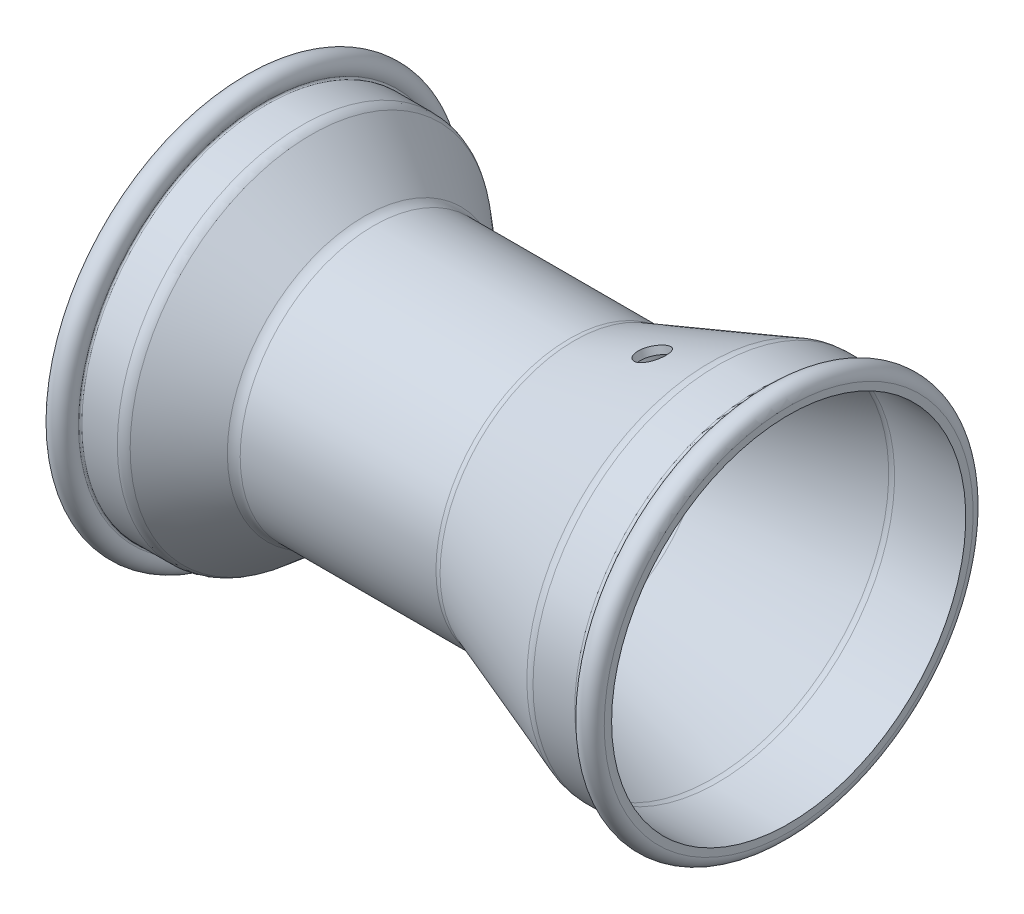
from build123d import *

# Parameters (mm, degrees)
ENL_V_MAT_EXTRU_1_REACH      = 197.343
ESQUISSE2_R                  = 5
ESQUISSE3_R                  = 4.5
ENL_V_MAT_EXTRU_2_DEPTH      = 155.667385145
R_P_TITION_CIRCULAIRE1_COUNT = 3


with BuildPart() as part:
    # Esquisse1 → Base-R_volution (revolve)
    with BuildSketch(Plane.XY, mode=Mode.PRIVATE) as base_r_volution_sk:
        with BuildLine():
            Line((-141.555203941, 65), (-141.555203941, 61))
            Line((-141.555203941, 61), (-141.555203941, 60))
            Line((-141.555203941, 60), (-137.74427744, 60))
            Line((-137.74427744, 60), (-121.555203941, 60))
            ThreePointArc((-121.555203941, 60), (-120.704160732, 59.850686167), (-119.954775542, 59.420580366))
            Line((-119.954775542, 59.420580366), (-101.993796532, 44.453614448))
            ThreePointArc((-101.993796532, 44.453614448), (-99.745640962, 43.163297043), (-97.192511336, 42.715355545))
            Line((-97.192511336, 42.715355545), (-78.555203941, 42.715355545))
            ThreePointArc((-78.555203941, 42.715355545), (-77.140990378, 42.129569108), (-76.555203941, 40.715355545))
            Line((-76.555203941, 40.715355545), (-76.555203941, 20))
            Line((-76.555203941, 20), (-69.555203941, 20))
            Line((-69.555203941, 20), (-69.555203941, 40.715355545))
            ThreePointArc((-69.555203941, 40.715355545), (-68.969417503, 42.129569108), (-67.555203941, 42.715355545))
            Line((-67.555203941, 42.715355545), (-30.864418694, 42.715355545))
            ThreePointArc((-30.864418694, 42.715355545), (-29.574706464, 42.827078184), (-28.323418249, 43.158917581))
            Line((-28.323418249, 43.158917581), (17.623605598, 59.704291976))
            ThreePointArc((17.623605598, 59.704291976), (18.457797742, 59.925518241), (19.317605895, 60))
            Line((19.317605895, 60), (35.506679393, 60))
            Line((35.506679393, 60), (43.444796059, 60))
            Line((43.444796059, 60), (43.444796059, 61))
            Line((43.444796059, 61), (43.444796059, 62.5))
            ThreePointArc((43.444796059, 62.5), (40.2292606, 66.422322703), (35.752488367, 64.038461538))
            ThreePointArc((35.752488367, 64.038461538), (34.83154655, 62.919874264), (33.444796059, 62.5))
            Line((33.444796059, 62.5), (19.317605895, 62.5))
            ThreePointArc((19.317605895, 62.5), (18.027893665, 62.388277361), (16.77660545, 62.056437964))
            Line((16.77660545, 62.056437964), (-29.170418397, 45.511063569))
            ThreePointArc((-29.170418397, 45.511063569), (-30.004610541, 45.289837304), (-30.864418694, 45.215355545))
            Line((-30.864418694, 45.215355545), (-97.192511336, 45.215355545))
            ThreePointArc((-97.192511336, 45.215355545), (-98.894597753, 45.513983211), (-100.393368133, 46.374194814))
            Line((-100.393368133, 46.374194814), (-118.354347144, 61.341160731))
            ThreePointArc((-118.354347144, 61.341160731), (-119.853117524, 62.201372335), (-121.555203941, 62.5))
            Line((-121.555203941, 62.5), (-133.555203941, 62.5))
            ThreePointArc((-133.555203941, 62.5), (-133.964655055, 62.728799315), (-133.98438849, 63.197424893))
            ThreePointArc((-133.98438849, 63.197424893), (-136.628721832, 68.891224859), (-141.555203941, 65))
        make_face()
    revolve(base_r_volution_sk.sketch.rotate(Axis((-112, 0, 0), (1, 0, 0)), 90), axis=Axis((-112, 0, 0), (1, 0, 0)))

    # Esquisse2 → Enl_v. mat.-Extru.1 (cut, up to next)
    with BuildSketch(Plane(origin=(-6.196906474, 53.783750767, 0), x_dir=(0, 0, -1), z_dir=(-0.3388000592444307, 0.9408583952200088, 0)), mode=Mode.PRIVATE) as enl_v_mat_extru_1_sk1:
        with Locations(Location((0, -3.569426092, 0), (0, 0, 48.450545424))):
            Circle(ESQUISSE2_R)
    enl_v_mat_extru_1_tool1 = extrude(enl_v_mat_extru_1_sk1.sketch, amount=-ENL_V_MAT_EXTRU_1_REACH, mode=Mode.PRIVATE) & part.part
    add(enl_v_mat_extru_1_tool1.solids().sort_by_distance((-2.838582, 54.993073, 0))[0], mode=Mode.SUBTRACT)

    # Esquisse3 → Enl_v. mat.-Extru.2 (cut, through all)
    with BuildSketch(Plane.ZY.offset(76.555203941)):
        with Locations((0, 30)):
            Circle(ESQUISSE3_R)
    enl_v_mat_extru_2 = extrude(amount=-ENL_V_MAT_EXTRU_2_DEPTH, mode=Mode.SUBTRACT)

    # R_p_tition circulaire1: Enl_v. mat.-Extru.2 ×3 about axis
    r_p_tition_circulaire1_axis = Axis((-112, 0, 0), (1, 0, 0))
    for i in range(1, R_P_TITION_CIRCULAIRE1_COUNT):
        add(enl_v_mat_extru_2.rotate(r_p_tition_circulaire1_axis, i * 360 / R_P_TITION_CIRCULAIRE1_COUNT), mode=Mode.SUBTRACT)


solid = part.part
